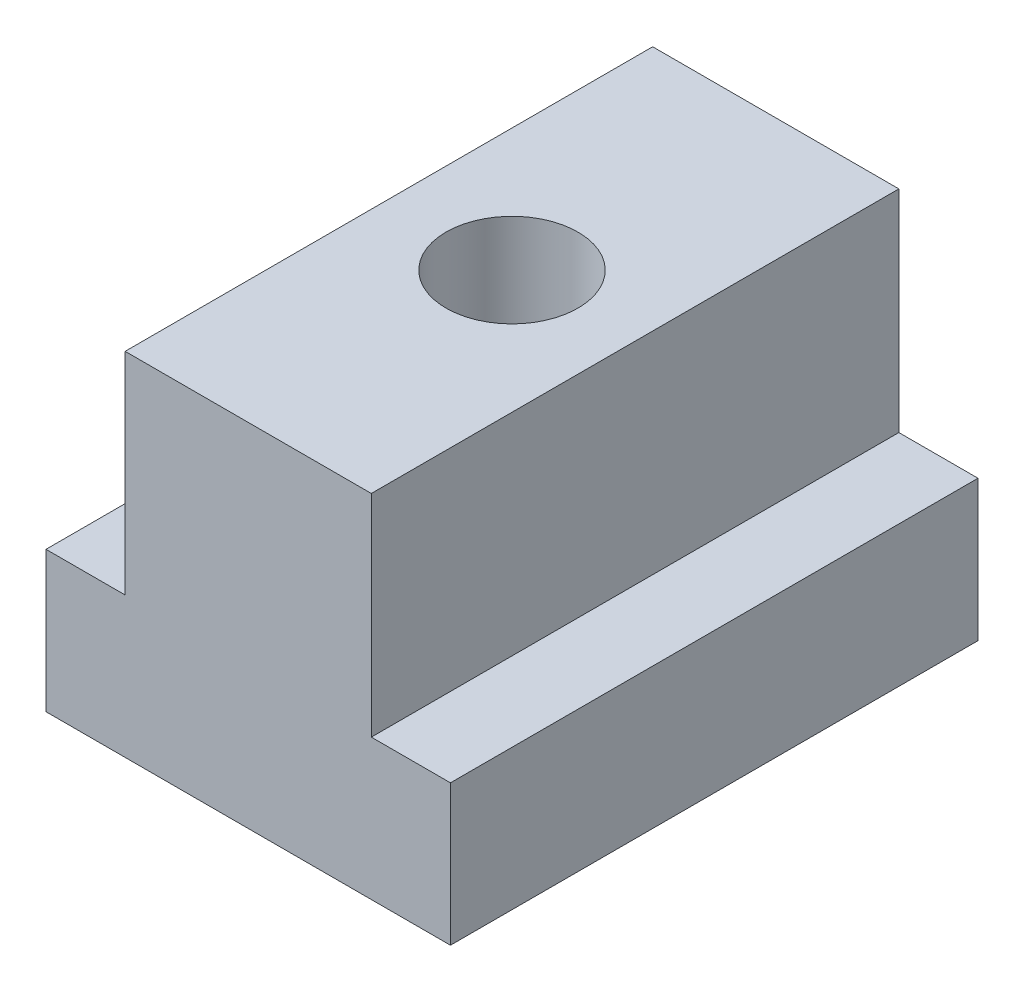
from build123d import *

# Parameters (mm, degrees)
EXTRUSION1_DEPTH        = 15
ESQUISSE2_R             = 3.75
ENL_V_MAT_EXTRU_1_DEPTH = 28.518175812


with BuildPart() as part:
    # Esquisse1 → Extrusion1 (new, symmetric)
    with BuildSketch(Plane.XY):
        Polygon((-11.5, 0), (11.5, 0), (11.5, 8), (7, 8), (7, 20), (-7, 20), (-7, 8), (-11.5, 8), align=None)
    extrude(amount=EXTRUSION1_DEPTH, both=True)

    # Esquisse2 → Enl_v. mat.-Extru.1 (cut, through all)
    with BuildSketch(Plane(origin=(0, 20, 0), x_dir=(1, 0, 0), z_dir=(0, 1, 0))):
        with Locations(Location((0, 0, 0), (0, 0, 180))):
            Circle(ESQUISSE2_R)
    extrude(amount=-ENL_V_MAT_EXTRU_1_DEPTH, mode=Mode.SUBTRACT)


solid = part.part
